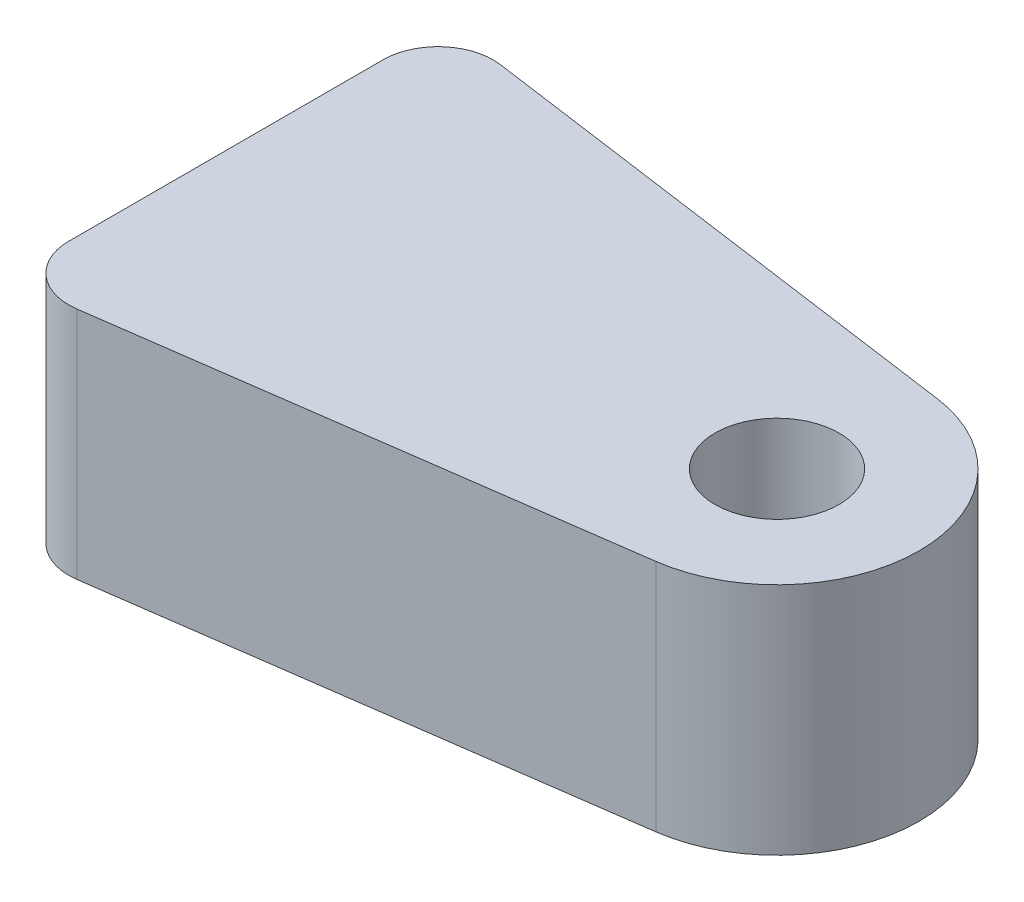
ISO-10303-21;
HEADER;
FILE_DESCRIPTION(('STEP AP214'),'2;1');
FILE_NAME('part.step','',(''),(''),'','','');
FILE_SCHEMA(('AUTOMOTIVE_DESIGN { 1 0 10303 214 1 1 1 1 }'));
ENDSEC;
DATA;
#1=APPLICATION_CONTEXT('core data for automotive mechanical design processes');
#2=APPLICATION_PROTOCOL_DEFINITION('international standard','automotive_design',2000,#1);
#3=PRODUCT_CONTEXT('',#1,'mechanical');
#4=PRODUCT('Part','Part','',(#3));
#5=PRODUCT_RELATED_PRODUCT_CATEGORY('part','',(#4));
#6=PRODUCT_DEFINITION_FORMATION('','',#4);
#7=PRODUCT_DEFINITION_CONTEXT('part definition',#1,'design');
#8=PRODUCT_DEFINITION('design','',#6,#7);
#9=PRODUCT_DEFINITION_SHAPE('','',#8);
#10=(LENGTH_UNIT() NAMED_UNIT(*) SI_UNIT(.MILLI.,.METRE.));
#11=(NAMED_UNIT(*) PLANE_ANGLE_UNIT() SI_UNIT($,.RADIAN.));
#12=(NAMED_UNIT(*) SI_UNIT($,.STERADIAN.) SOLID_ANGLE_UNIT());
#13=UNCERTAINTY_MEASURE_WITH_UNIT(LENGTH_MEASURE(1.E-05),#10,'distance_accuracy_value','');
#14=(GEOMETRIC_REPRESENTATION_CONTEXT(3) GLOBAL_UNCERTAINTY_ASSIGNED_CONTEXT((#13)) GLOBAL_UNIT_ASSIGNED_CONTEXT((#10,
#11,#12)) REPRESENTATION_CONTEXT('',''));
#15=CARTESIAN_POINT('',(0.,0.,0.));
#16=DIRECTION('',(0.,0.,1.));
#17=DIRECTION('',(1.,0.,0.));
#18=AXIS2_PLACEMENT_3D('',#15,#16,#17);
#19=CARTESIAN_POINT('',(0.,2.5,0.));
#20=DIRECTION('',(0.,-1.,0.));
#21=DIRECTION('',(0.,0.,-1.));
#22=AXIS2_PLACEMENT_3D('',#19,#20,#21);
#23=CYLINDRICAL_SURFACE('',#22,5.15802983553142);
#24=DIRECTION('',(0.,-1.,0.));
#25=VECTOR('',#24,1.);
#26=CARTESIAN_POINT('',(0.713134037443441,8.5,-5.10849406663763));
#27=LINE('',#26,#25);
#28=CARTESIAN_POINT('',(0.713134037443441,8.5,-5.10849406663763));
#29=VERTEX_POINT('',#28);
#30=CARTESIAN_POINT('',(0.713134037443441,0.,-5.10849406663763));
#31=VERTEX_POINT('',#30);
#32=EDGE_CURVE('E113',#29,#31,#27,.T.);
#33=ORIENTED_EDGE('',*,*,#32,.F.);
#34=CARTESIAN_POINT('',(0.,8.5,0.));
#35=DIRECTION('',(0.,1.,0.));
#36=DIRECTION('',(0.,0.,1.));
#37=AXIS2_PLACEMENT_3D('',#34,#35,#36);
#38=CIRCLE('',#37,5.15802983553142);
#39=CARTESIAN_POINT('',(0.713134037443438,8.5,5.10849406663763));
#40=VERTEX_POINT('',#39);
#41=EDGE_CURVE('E112',#40,#29,#38,.T.);
#42=ORIENTED_EDGE('',*,*,#41,.F.);
#43=DIRECTION('',(0.,-1.,0.));
#44=VECTOR('',#43,1.);
#45=CARTESIAN_POINT('',(0.713134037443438,8.5,5.10849406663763));
#46=LINE('',#45,#44);
#47=CARTESIAN_POINT('',(0.713134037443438,0.,5.10849406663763));
#48=VERTEX_POINT('',#47);
#49=EDGE_CURVE('E94',#40,#48,#46,.T.);
#50=ORIENTED_EDGE('',*,*,#49,.T.);
#51=CARTESIAN_POINT('',(0.,0.,0.));
#52=DIRECTION('',(0.,1.,0.));
#53=DIRECTION('',(0.,0.,1.));
#54=AXIS2_PLACEMENT_3D('',#51,#52,#53);
#55=CIRCLE('',#54,5.15802983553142);
#56=EDGE_CURVE('E102',#48,#31,#55,.T.);
#57=ORIENTED_EDGE('',*,*,#56,.T.);
#58=EDGE_LOOP('',(#33,#42,#50,#57));
#59=FACE_BOUND('',#58,.T.);
#60=ADVANCED_FACE('F33',(#59),#23,.T.);
#61=CARTESIAN_POINT('',(0.,8.5,0.));
#62=DIRECTION('',(0.,-1.,0.));
#63=DIRECTION('',(0.,0.,-1.));
#64=AXIS2_PLACEMENT_3D('',#61,#62,#63);
#65=CYLINDRICAL_SURFACE('',#64,1.);
#66=CARTESIAN_POINT('',(0.,2.5,0.));
#67=DIRECTION('',(0.,1.,0.));
#68=DIRECTION('',(0.,0.,1.));
#69=AXIS2_PLACEMENT_3D('',#66,#67,#68);
#70=CIRCLE('',#69,1.);
#71=CARTESIAN_POINT('',(0.,2.5,1.));
#72=VERTEX_POINT('',#71);
#73=EDGE_CURVE('E128',#72,#72,#70,.T.);
#74=ORIENTED_EDGE('',*,*,#73,.F.);
#75=EDGE_LOOP('',(#74));
#76=FACE_BOUND('',#75,.T.);
#77=CARTESIAN_POINT('',(0.,4.,0.));
#78=DIRECTION('',(0.,1.,0.));
#79=DIRECTION('',(0.,0.,1.));
#80=AXIS2_PLACEMENT_3D('',#77,#78,#79);
#81=CIRCLE('',#80,1.);
#82=CARTESIAN_POINT('',(0.,4.,1.));
#83=VERTEX_POINT('',#82);
#84=EDGE_CURVE('E125',#83,#83,#81,.T.);
#85=ORIENTED_EDGE('',*,*,#84,.T.);
#86=EDGE_LOOP('',(#85));
#87=FACE_BOUND('',#86,.T.);
#88=ADVANCED_FACE('F176',(#76,#87),#65,.F.);
#89=CARTESIAN_POINT('',(0.,0.,0.));
#90=DIRECTION('',(0.,1.,0.));
#91=DIRECTION('',(0.,0.,1.));
#92=AXIS2_PLACEMENT_3D('',#89,#90,#91);
#93=PLANE('',#92);
#94=DIRECTION('',(0.990396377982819,0.,-0.138257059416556));
#95=VECTOR('',#94,1.);
#96=CARTESIAN_POINT('',(-20.,0.,8.));
#97=LINE('',#96,#95);
#98=CARTESIAN_POINT('',(-17.7234858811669,0.,7.68220385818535));
#99=VERTEX_POINT('',#98);
#100=EDGE_CURVE('E89',#99,#48,#97,.T.);
#101=ORIENTED_EDGE('',*,*,#100,.F.);
#102=CARTESIAN_POINT('',(-18.,0.,5.70141110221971));
#103=DIRECTION('',(0.,1.,0.));
#104=DIRECTION('',(0.,0.,1.));
#105=AXIS2_PLACEMENT_3D('',#102,#103,#104);
#106=CIRCLE('',#105,2.);
#107=CARTESIAN_POINT('',(-20.,0.,5.70141110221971));
#108=VERTEX_POINT('',#107);
#109=EDGE_CURVE('E142',#99,#108,#106,.F.);
#110=ORIENTED_EDGE('',*,*,#109,.T.);
#111=DIRECTION('',(0.,0.,1.));
#112=VECTOR('',#111,1.);
#113=CARTESIAN_POINT('',(-20.,0.,-8.00000000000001));
#114=LINE('',#113,#112);
#115=CARTESIAN_POINT('',(-20.,0.,-5.70141110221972));
#116=VERTEX_POINT('',#115);
#117=EDGE_CURVE('E99',#116,#108,#114,.T.);
#118=ORIENTED_EDGE('',*,*,#117,.F.);
#119=CARTESIAN_POINT('',(-18.,0.,-5.70141110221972));
#120=DIRECTION('',(0.,1.,0.));
#121=DIRECTION('',(0.,0.,1.));
#122=AXIS2_PLACEMENT_3D('',#119,#120,#121);
#123=CIRCLE('',#122,2.);
#124=CARTESIAN_POINT('',(-17.7234858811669,0.,-7.68220385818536));
#125=VERTEX_POINT('',#124);
#126=EDGE_CURVE('E140',#116,#125,#123,.F.);
#127=ORIENTED_EDGE('',*,*,#126,.T.);
#128=DIRECTION('',(-0.990396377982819,0.,-0.138257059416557));
#129=VECTOR('',#128,1.);
#130=CARTESIAN_POINT('',(0.713134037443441,0.,-5.10849406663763));
#131=LINE('',#130,#129);
#132=EDGE_CURVE('E105',#31,#125,#131,.T.);
#133=ORIENTED_EDGE('',*,*,#132,.F.);
#134=ORIENTED_EDGE('',*,*,#56,.F.);
#135=EDGE_LOOP('',(#101,#110,#118,#127,#133,#134));
#136=FACE_BOUND('',#135,.T.);
#137=CARTESIAN_POINT('',(0.,0.,0.));
#138=DIRECTION('',(0.,1.,0.));
#139=DIRECTION('',(0.,0.,1.));
#140=AXIS2_PLACEMENT_3D('',#137,#138,#139);
#141=CIRCLE('',#140,2.45);
#142=CARTESIAN_POINT('',(0.,0.,2.45));
#143=VERTEX_POINT('',#142);
#144=EDGE_CURVE('E108',#143,#143,#141,.T.);
#145=ORIENTED_EDGE('',*,*,#144,.T.);
#146=EDGE_LOOP('',(#145));
#147=FACE_BOUND('',#146,.T.);
#148=ADVANCED_FACE('F103',(#136,#147),#93,.F.);
#149=CARTESIAN_POINT('',(0.,2.5,0.));
#150=DIRECTION('',(0.,-1.,0.));
#151=DIRECTION('',(0.,0.,-1.));
#152=AXIS2_PLACEMENT_3D('',#149,#150,#151);
#153=CYLINDRICAL_SURFACE('',#152,2.45);
#154=CARTESIAN_POINT('',(0.,2.5,0.));
#155=DIRECTION('',(0.,1.,0.));
#156=DIRECTION('',(0.,0.,1.));
#157=AXIS2_PLACEMENT_3D('',#154,#155,#156);
#158=CIRCLE('',#157,2.45);
#159=CARTESIAN_POINT('',(0.,2.5,2.45));
#160=VERTEX_POINT('',#159);
#161=EDGE_CURVE('E132',#160,#160,#158,.T.);
#162=ORIENTED_EDGE('',*,*,#161,.T.);
#163=EDGE_LOOP('',(#162));
#164=FACE_BOUND('',#163,.T.);
#165=ORIENTED_EDGE('',*,*,#144,.F.);
#166=EDGE_LOOP('',(#165));
#167=FACE_BOUND('',#166,.T.);
#168=ADVANCED_FACE('F221',(#164,#167),#153,.F.);
#169=CARTESIAN_POINT('',(0.,2.5,0.));
#170=DIRECTION('',(0.,1.,0.));
#171=DIRECTION('',(0.,0.,1.));
#172=AXIS2_PLACEMENT_3D('',#169,#170,#171);
#173=PLANE('',#172);
#174=ORIENTED_EDGE('',*,*,#73,.T.);
#175=EDGE_LOOP('',(#174));
#176=FACE_BOUND('',#175,.T.);
#177=ORIENTED_EDGE('',*,*,#161,.F.);
#178=EDGE_LOOP('',(#177));
#179=FACE_BOUND('',#178,.T.);
#180=ADVANCED_FACE('F210',(#176,#179),#173,.F.);
#181=CARTESIAN_POINT('',(0.,8.5,0.));
#182=DIRECTION('',(0.,1.,0.));
#183=DIRECTION('',(0.,0.,1.));
#184=AXIS2_PLACEMENT_3D('',#181,#182,#183);
#185=PLANE('',#184);
#186=DIRECTION('',(0.,0.,1.));
#187=VECTOR('',#186,1.);
#188=CARTESIAN_POINT('',(-20.,8.5,-8.00000000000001));
#189=LINE('',#188,#187);
#190=CARTESIAN_POINT('',(-20.,8.5,-5.70141110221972));
#191=VERTEX_POINT('',#190);
#192=CARTESIAN_POINT('',(-20.,8.5,5.70141110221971));
#193=VERTEX_POINT('',#192);
#194=EDGE_CURVE('E118',#191,#193,#189,.T.);
#195=ORIENTED_EDGE('',*,*,#194,.T.);
#196=CARTESIAN_POINT('',(-18.,8.5,5.70141110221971));
#197=DIRECTION('',(0.,1.,0.));
#198=DIRECTION('',(0.,0.,1.));
#199=AXIS2_PLACEMENT_3D('',#196,#197,#198);
#200=CIRCLE('',#199,2.);
#201=CARTESIAN_POINT('',(-17.7234858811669,8.5,7.68220385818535));
#202=VERTEX_POINT('',#201);
#203=EDGE_CURVE('E41',#193,#202,#200,.T.);
#204=ORIENTED_EDGE('',*,*,#203,.T.);
#205=DIRECTION('',(0.990396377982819,0.,-0.138257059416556));
#206=VECTOR('',#205,1.);
#207=CARTESIAN_POINT('',(-20.,8.5,8.));
#208=LINE('',#207,#206);
#209=EDGE_CURVE('E114',#202,#40,#208,.T.);
#210=ORIENTED_EDGE('',*,*,#209,.T.);
#211=ORIENTED_EDGE('',*,*,#41,.T.);
#212=DIRECTION('',(-0.990396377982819,0.,-0.138257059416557));
#213=VECTOR('',#212,1.);
#214=CARTESIAN_POINT('',(0.713134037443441,8.5,-5.10849406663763));
#215=LINE('',#214,#213);
#216=CARTESIAN_POINT('',(-17.7234858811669,8.5,-7.68220385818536));
#217=VERTEX_POINT('',#216);
#218=EDGE_CURVE('E98',#29,#217,#215,.T.);
#219=ORIENTED_EDGE('',*,*,#218,.T.);
#220=CARTESIAN_POINT('',(-18.,8.5,-5.70141110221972));
#221=DIRECTION('',(0.,1.,0.));
#222=DIRECTION('',(0.,0.,1.));
#223=AXIS2_PLACEMENT_3D('',#220,#221,#222);
#224=CIRCLE('',#223,2.);
#225=EDGE_CURVE('E148',#217,#191,#224,.T.);
#226=ORIENTED_EDGE('',*,*,#225,.T.);
#227=EDGE_LOOP('',(#195,#204,#210,#211,#219,#226));
#228=FACE_BOUND('',#227,.T.);
#229=CARTESIAN_POINT('',(0.,8.5,0.));
#230=DIRECTION('',(0.,1.,0.));
#231=DIRECTION('',(0.,0.,1.));
#232=AXIS2_PLACEMENT_3D('',#229,#230,#231);
#233=CIRCLE('',#232,2.25);
#234=CARTESIAN_POINT('',(0.,8.5,2.25));
#235=VERTEX_POINT('',#234);
#236=EDGE_CURVE('E116',#235,#235,#233,.T.);
#237=ORIENTED_EDGE('',*,*,#236,.F.);
#238=EDGE_LOOP('',(#237));
#239=FACE_BOUND('',#238,.T.);
#240=ADVANCED_FACE('F151',(#228,#239),#185,.T.);
#241=CARTESIAN_POINT('',(0.,4.,0.));
#242=DIRECTION('',(0.,1.,0.));
#243=DIRECTION('',(0.,0.,1.));
#244=AXIS2_PLACEMENT_3D('',#241,#242,#243);
#245=CYLINDRICAL_SURFACE('',#244,2.25);
#246=CARTESIAN_POINT('',(0.,4.,0.));
#247=DIRECTION('',(0.,1.,0.));
#248=DIRECTION('',(0.,0.,1.));
#249=AXIS2_PLACEMENT_3D('',#246,#247,#248);
#250=CIRCLE('',#249,2.25);
#251=CARTESIAN_POINT('',(0.,4.,2.25));
#252=VERTEX_POINT('',#251);
#253=EDGE_CURVE('E122',#252,#252,#250,.T.);
#254=ORIENTED_EDGE('',*,*,#253,.F.);
#255=EDGE_LOOP('',(#254));
#256=FACE_BOUND('',#255,.T.);
#257=ORIENTED_EDGE('',*,*,#236,.T.);
#258=EDGE_LOOP('',(#257));
#259=FACE_BOUND('',#258,.T.);
#260=ADVANCED_FACE('F172',(#256,#259),#245,.F.);
#261=CARTESIAN_POINT('',(0.,4.,0.));
#262=DIRECTION('',(0.,1.,0.));
#263=DIRECTION('',(0.,0.,1.));
#264=AXIS2_PLACEMENT_3D('',#261,#262,#263);
#265=PLANE('',#264);
#266=ORIENTED_EDGE('',*,*,#84,.F.);
#267=EDGE_LOOP('',(#266));
#268=FACE_BOUND('',#267,.T.);
#269=ORIENTED_EDGE('',*,*,#253,.T.);
#270=EDGE_LOOP('',(#269));
#271=FACE_BOUND('',#270,.T.);
#272=ADVANCED_FACE('F165',(#268,#271),#265,.T.);
#273=CARTESIAN_POINT('',(0.713134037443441,8.5,-5.10849406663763));
#274=DIRECTION('',(-0.138257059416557,0.,0.990396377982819));
#275=DIRECTION('',(0.990396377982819,0.,0.138257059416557));
#276=AXIS2_PLACEMENT_3D('',#273,#274,#275);
#277=PLANE('',#276);
#278=ORIENTED_EDGE('',*,*,#132,.T.);
#279=DIRECTION('',(0.,-1.,0.));
#280=VECTOR('',#279,1.);
#281=CARTESIAN_POINT('',(-17.7234858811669,8.5,-7.68220385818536));
#282=LINE('',#281,#280);
#283=EDGE_CURVE('E11',#125,#217,#282,.F.);
#284=ORIENTED_EDGE('',*,*,#283,.T.);
#285=ORIENTED_EDGE('',*,*,#218,.F.);
#286=ORIENTED_EDGE('',*,*,#32,.T.);
#287=EDGE_LOOP('',(#278,#284,#285,#286));
#288=FACE_BOUND('',#287,.T.);
#289=ADVANCED_FACE('F163',(#288),#277,.F.);
#290=CARTESIAN_POINT('',(-20.,8.5,-8.00000000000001));
#291=DIRECTION('',(1.,0.,0.));
#292=DIRECTION('',(0.,0.,-1.));
#293=AXIS2_PLACEMENT_3D('',#290,#291,#292);
#294=PLANE('',#293);
#295=ORIENTED_EDGE('',*,*,#117,.T.);
#296=DIRECTION('',(0.,-1.,0.));
#297=VECTOR('',#296,1.);
#298=CARTESIAN_POINT('',(-20.,8.5,5.70141110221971));
#299=LINE('',#298,#297);
#300=EDGE_CURVE('E54',#108,#193,#299,.F.);
#301=ORIENTED_EDGE('',*,*,#300,.T.);
#302=ORIENTED_EDGE('',*,*,#194,.F.);
#303=DIRECTION('',(0.,-1.,0.));
#304=VECTOR('',#303,1.);
#305=CARTESIAN_POINT('',(-20.,8.5,-5.70141110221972));
#306=LINE('',#305,#304);
#307=EDGE_CURVE('E144',#191,#116,#306,.T.);
#308=ORIENTED_EDGE('',*,*,#307,.T.);
#309=EDGE_LOOP('',(#295,#301,#302,#308));
#310=FACE_BOUND('',#309,.T.);
#311=ADVANCED_FACE('F156',(#310),#294,.F.);
#312=CARTESIAN_POINT('',(-20.,8.5,8.));
#313=DIRECTION('',(-0.138257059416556,0.,-0.990396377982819));
#314=DIRECTION('',(-0.990396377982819,0.,0.138257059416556));
#315=AXIS2_PLACEMENT_3D('',#312,#313,#314);
#316=PLANE('',#315);
#317=ORIENTED_EDGE('',*,*,#209,.F.);
#318=DIRECTION('',(0.,-1.,0.));
#319=VECTOR('',#318,1.);
#320=CARTESIAN_POINT('',(-17.7234858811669,8.5,7.68220385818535));
#321=LINE('',#320,#319);
#322=EDGE_CURVE('E96',#202,#99,#321,.T.);
#323=ORIENTED_EDGE('',*,*,#322,.T.);
#324=ORIENTED_EDGE('',*,*,#100,.T.);
#325=ORIENTED_EDGE('',*,*,#49,.F.);
#326=EDGE_LOOP('',(#317,#323,#324,#325));
#327=FACE_BOUND('',#326,.T.);
#328=ADVANCED_FACE('F92',(#327),#316,.F.);
#329=CARTESIAN_POINT('',(-18.,8.5,5.70141110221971));
#330=DIRECTION('',(0.,-1.,0.));
#331=DIRECTION('',(0.,0.,-1.));
#332=AXIS2_PLACEMENT_3D('',#329,#330,#331);
#333=CYLINDRICAL_SURFACE('',#332,2.);
#334=ORIENTED_EDGE('',*,*,#203,.F.);
#335=ORIENTED_EDGE('',*,*,#300,.F.);
#336=ORIENTED_EDGE('',*,*,#109,.F.);
#337=ORIENTED_EDGE('',*,*,#322,.F.);
#338=EDGE_LOOP('',(#334,#335,#336,#337));
#339=FACE_BOUND('',#338,.T.);
#340=ADVANCED_FACE('F154',(#339),#333,.T.);
#341=CARTESIAN_POINT('',(-18.,8.5,-5.70141110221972));
#342=DIRECTION('',(0.,-1.,0.));
#343=DIRECTION('',(0.,0.,-1.));
#344=AXIS2_PLACEMENT_3D('',#341,#342,#343);
#345=CYLINDRICAL_SURFACE('',#344,2.);
#346=ORIENTED_EDGE('',*,*,#225,.F.);
#347=ORIENTED_EDGE('',*,*,#283,.F.);
#348=ORIENTED_EDGE('',*,*,#126,.F.);
#349=ORIENTED_EDGE('',*,*,#307,.F.);
#350=EDGE_LOOP('',(#346,#347,#348,#349));
#351=FACE_BOUND('',#350,.T.);
#352=ADVANCED_FACE('F35',(#351),#345,.T.);
#353=CLOSED_SHELL('',(#60,#88,#148,#168,#180,#240,#260,#272,#289,#311,#328,#340,#352));
#354=MANIFOLD_SOLID_BREP('B2',#353);
#355=ADVANCED_BREP_SHAPE_REPRESENTATION('',(#18,#354),#14);
#356=SHAPE_DEFINITION_REPRESENTATION(#9,#355);
ENDSEC;
END-ISO-10303-21;
